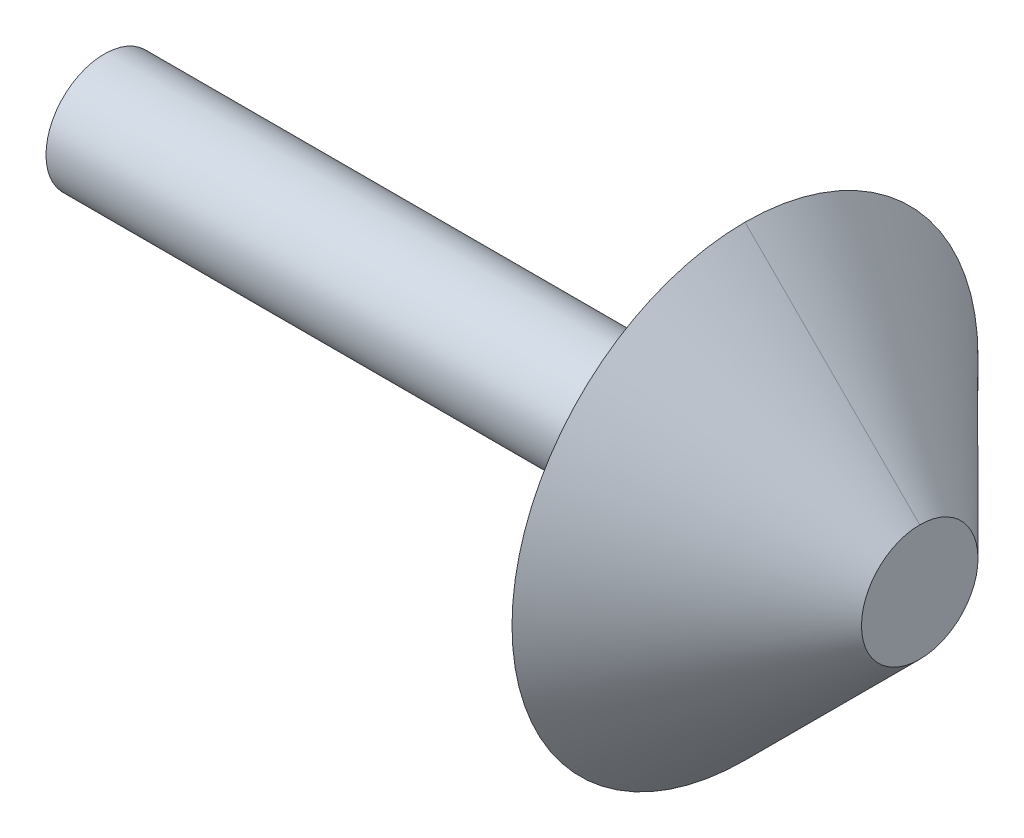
ISO-10303-21;
HEADER;
FILE_DESCRIPTION(('STEP AP214'),'2;1');
FILE_NAME('part.step','',(''),(''),'','','');
FILE_SCHEMA(('AUTOMOTIVE_DESIGN { 1 0 10303 214 1 1 1 1 }'));
ENDSEC;
DATA;
#1=APPLICATION_CONTEXT('core data for automotive mechanical design processes');
#2=APPLICATION_PROTOCOL_DEFINITION('international standard','automotive_design',2000,#1);
#3=PRODUCT_CONTEXT('',#1,'mechanical');
#4=PRODUCT('Part','Part','',(#3));
#5=PRODUCT_RELATED_PRODUCT_CATEGORY('part','',(#4));
#6=PRODUCT_DEFINITION_FORMATION('','',#4);
#7=PRODUCT_DEFINITION_CONTEXT('part definition',#1,'design');
#8=PRODUCT_DEFINITION('design','',#6,#7);
#9=PRODUCT_DEFINITION_SHAPE('','',#8);
#10=(LENGTH_UNIT() NAMED_UNIT(*) SI_UNIT(.MILLI.,.METRE.));
#11=(NAMED_UNIT(*) PLANE_ANGLE_UNIT() SI_UNIT($,.RADIAN.));
#12=(NAMED_UNIT(*) SI_UNIT($,.STERADIAN.) SOLID_ANGLE_UNIT());
#13=UNCERTAINTY_MEASURE_WITH_UNIT(LENGTH_MEASURE(1.E-05),#10,'distance_accuracy_value','');
#14=(GEOMETRIC_REPRESENTATION_CONTEXT(3) GLOBAL_UNCERTAINTY_ASSIGNED_CONTEXT((#13)) GLOBAL_UNIT_ASSIGNED_CONTEXT((#10,
#11,#12)) REPRESENTATION_CONTEXT('',''));
#15=CARTESIAN_POINT('',(0.,0.,0.));
#16=DIRECTION('',(0.,0.,1.));
#17=DIRECTION('',(1.,0.,0.));
#18=AXIS2_PLACEMENT_3D('',#15,#16,#17);
#19=CARTESIAN_POINT('',(88.9,0.,0.));
#20=DIRECTION('',(-1.,0.,0.));
#21=DIRECTION('',(0.,0.,1.));
#22=AXIS2_PLACEMENT_3D('',#19,#20,#21);
#23=CONICAL_SURFACE('',#22,6.35000000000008,0.785398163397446);
#24=CARTESIAN_POINT('',(88.9,0.,0.));
#25=DIRECTION('',(-1.,0.,0.));
#26=DIRECTION('',(0.,0.,1.));
#27=AXIS2_PLACEMENT_3D('',#24,#25,#26);
#28=CIRCLE('',#27,6.35000000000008);
#29=CARTESIAN_POINT('',(88.9,6.35000000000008,0.));
#30=VERTEX_POINT('',#29);
#31=CARTESIAN_POINT('',(88.9,-6.35000000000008,0.));
#32=VERTEX_POINT('',#31);
#33=EDGE_CURVE('E378',#30,#32,#28,.T.);
#34=ORIENTED_EDGE('',*,*,#33,.T.);
#35=DIRECTION('',(-0.707106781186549,-0.707106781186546,0.));
#36=VECTOR('',#35,1.);
#37=CARTESIAN_POINT('',(88.9,-6.35000000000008,0.));
#38=LINE('',#37,#36);
#39=CARTESIAN_POINT('',(69.85,-25.4,0.));
#40=VERTEX_POINT('',#39);
#41=EDGE_CURVE('E11',#32,#40,#38,.T.);
#42=ORIENTED_EDGE('',*,*,#41,.T.);
#43=CARTESIAN_POINT('',(69.85,0.,0.));
#44=DIRECTION('',(-1.,0.,0.));
#45=DIRECTION('',(0.,0.,1.));
#46=AXIS2_PLACEMENT_3D('',#43,#44,#45);
#47=CIRCLE('',#46,25.4);
#48=CARTESIAN_POINT('',(69.85,25.4,0.));
#49=VERTEX_POINT('',#48);
#50=EDGE_CURVE('E377',#49,#40,#47,.T.);
#51=ORIENTED_EDGE('',*,*,#50,.F.);
#52=DIRECTION('',(0.707106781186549,-0.707106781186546,0.));
#53=VECTOR('',#52,1.);
#54=CARTESIAN_POINT('',(88.9,6.35000000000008,0.));
#55=LINE('',#54,#53);
#56=EDGE_CURVE('E357',#49,#30,#55,.T.);
#57=ORIENTED_EDGE('',*,*,#56,.T.);
#58=EDGE_LOOP('',(#34,#42,#51,#57));
#59=FACE_BOUND('',#58,.T.);
#60=ADVANCED_FACE('F348',(#59),#23,.T.);
#61=CARTESIAN_POINT('',(0.,0.,0.));
#62=DIRECTION('',(1.,0.,0.));
#63=DIRECTION('',(0.,0.,-1.));
#64=AXIS2_PLACEMENT_3D('',#61,#62,#63);
#65=PLANE('',#64);
#66=CARTESIAN_POINT('',(0.,0.,0.));
#67=DIRECTION('',(-1.,0.,0.));
#68=DIRECTION('',(0.,0.,1.));
#69=AXIS2_PLACEMENT_3D('',#66,#67,#68);
#70=CIRCLE('',#69,6.35);
#71=CARTESIAN_POINT('',(0.,0.,6.35));
#72=VERTEX_POINT('',#71);
#73=EDGE_CURVE('E385',#72,#72,#70,.T.);
#74=ORIENTED_EDGE('',*,*,#73,.T.);
#75=EDGE_LOOP('',(#74));
#76=FACE_BOUND('',#75,.T.);
#77=ADVANCED_FACE('F350',(#76),#65,.F.);
#78=CARTESIAN_POINT('',(0.,0.,0.));
#79=DIRECTION('',(-1.,0.,0.));
#80=DIRECTION('',(0.,0.,1.));
#81=AXIS2_PLACEMENT_3D('',#78,#79,#80);
#82=CYLINDRICAL_SURFACE('',#81,6.35);
#83=ORIENTED_EDGE('',*,*,#73,.F.);
#84=EDGE_LOOP('',(#83));
#85=FACE_BOUND('',#84,.T.);
#86=CARTESIAN_POINT('',(69.85,0.,0.));
#87=DIRECTION('',(-1.,0.,0.));
#88=DIRECTION('',(0.,0.,1.));
#89=AXIS2_PLACEMENT_3D('',#86,#87,#88);
#90=CIRCLE('',#89,6.35);
#91=CARTESIAN_POINT('',(69.85,0.,6.35));
#92=VERTEX_POINT('',#91);
#93=EDGE_CURVE('E386',#92,#92,#90,.T.);
#94=ORIENTED_EDGE('',*,*,#93,.T.);
#95=EDGE_LOOP('',(#94));
#96=FACE_BOUND('',#95,.T.);
#97=ADVANCED_FACE('F395',(#85,#96),#82,.T.);
#98=CARTESIAN_POINT('',(69.85,6.35,0.));
#99=DIRECTION('',(1.,0.,0.));
#100=DIRECTION('',(0.,0.,-1.));
#101=AXIS2_PLACEMENT_3D('',#98,#99,#100);
#102=PLANE('',#101);
#103=ORIENTED_EDGE('',*,*,#93,.F.);
#104=EDGE_LOOP('',(#103));
#105=FACE_BOUND('',#104,.T.);
#106=ORIENTED_EDGE('',*,*,#50,.T.);
#107=EDGE_CURVE('E374',#40,#49,#47,.T.);
#108=ORIENTED_EDGE('',*,*,#107,.T.);
#109=EDGE_LOOP('',(#106,#108));
#110=FACE_BOUND('',#109,.T.);
#111=ADVANCED_FACE('F376',(#105,#110),#102,.F.);
#112=ORIENTED_EDGE('',*,*,#41,.F.);
#113=EDGE_CURVE('E382',#32,#30,#28,.T.);
#114=ORIENTED_EDGE('',*,*,#113,.T.);
#115=ORIENTED_EDGE('',*,*,#56,.F.);
#116=ORIENTED_EDGE('',*,*,#107,.F.);
#117=EDGE_LOOP('',(#112,#114,#115,#116));
#118=FACE_BOUND('',#117,.T.);
#119=ADVANCED_FACE('F381',(#118),#23,.T.);
#120=CARTESIAN_POINT('',(88.9,6.35000000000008,0.));
#121=DIRECTION('',(-1.,0.,0.));
#122=DIRECTION('',(0.,0.,1.));
#123=AXIS2_PLACEMENT_3D('',#120,#121,#122);
#124=PLANE('',#123);
#125=ORIENTED_EDGE('',*,*,#33,.F.);
#126=ORIENTED_EDGE('',*,*,#113,.F.);
#127=EDGE_LOOP('',(#125,#126));
#128=FACE_BOUND('',#127,.T.);
#129=ADVANCED_FACE('F406',(#128),#124,.F.);
#130=CLOSED_SHELL('',(#60,#77,#97,#111,#119,#129));
#131=MANIFOLD_SOLID_BREP('B2',#130);
#132=ADVANCED_BREP_SHAPE_REPRESENTATION('',(#18,#131),#14);
#133=SHAPE_DEFINITION_REPRESENTATION(#9,#132);
ENDSEC;
END-ISO-10303-21;
